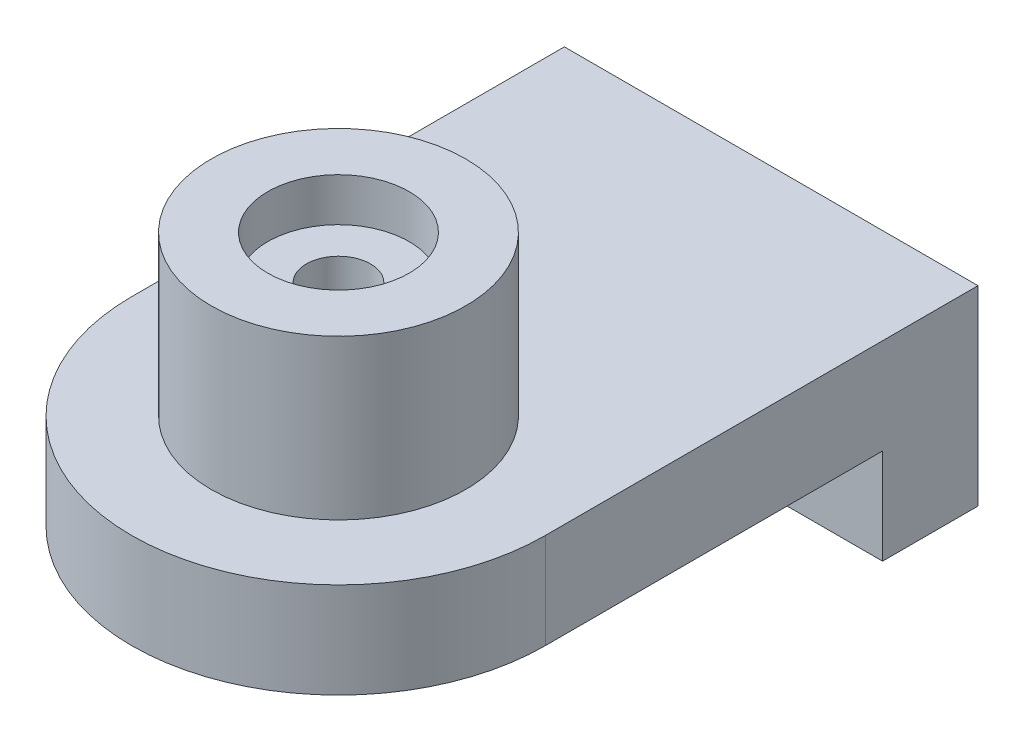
from build123d import *

# Parameters (mm, degrees)
EXTRUDE1_DEPTH                           = 15
SKETCH2_W                                = 65
SKETCH2_H                                = 15
EXTRUDE2_DEPTH                           = 15
SKETCH3_R                                = 20
EXTRUDE3_DEPTH                           = 25
CBORE_FOR_3_8_HEX_HEAD_BOLT1_D           = 10.0838
CBORE_FOR_3_8_HEX_HEAD_BOLT1_CBORE_D     = 22.225
CBORE_FOR_3_8_HEX_HEAD_BOLT1_CBORE_DEPTH = 6.8072


with BuildPart() as part:
    # Sketch1 → Extrude1 (new body)
    with BuildSketch(Plane(origin=(0, 0, 0), x_dir=(1, 0, 0), z_dir=(0, 1, 0))):
        with BuildLine():
            Line((-32.5, 0), (-32.5, 68))
            Line((-32.5, 68), (32.5, 68))
            Line((32.5, 68), (32.5, 0))
            ThreePointArc((32.5, 0), (0, -32.5), (-32.5, 0))
        make_face()
    extrude(amount=EXTRUDE1_DEPTH)

    # Sketch2 → Extrude2 (add)
    with BuildSketch(Plane.XZ):
        with Locations((0, -60.5)):
            Rectangle(SKETCH2_W, SKETCH2_H)
    extrude(amount=EXTRUDE2_DEPTH)

    # Sketch3 → Extrude3 (add)
    with BuildSketch(Plane(origin=(0, 15, 0), x_dir=(-1, 0, 0), z_dir=(0, 1, 0))):
        with Locations(Location((0, 0, 0), (0, 0, 270))):
            Circle(SKETCH3_R)
    extrude(amount=EXTRUDE3_DEPTH)

    # CBORE for 3_8 Hex Head Bolt1 (through all)
    with Locations(Plane(origin=(0, 40, 0), x_dir=(-1, 0, 0), z_dir=(0, 1, 0))):
        with Locations((0, 0)):
            CounterBoreHole(CBORE_FOR_3_8_HEX_HEAD_BOLT1_D / 2, CBORE_FOR_3_8_HEX_HEAD_BOLT1_CBORE_D / 2, CBORE_FOR_3_8_HEX_HEAD_BOLT1_CBORE_DEPTH)


solid = part.part
